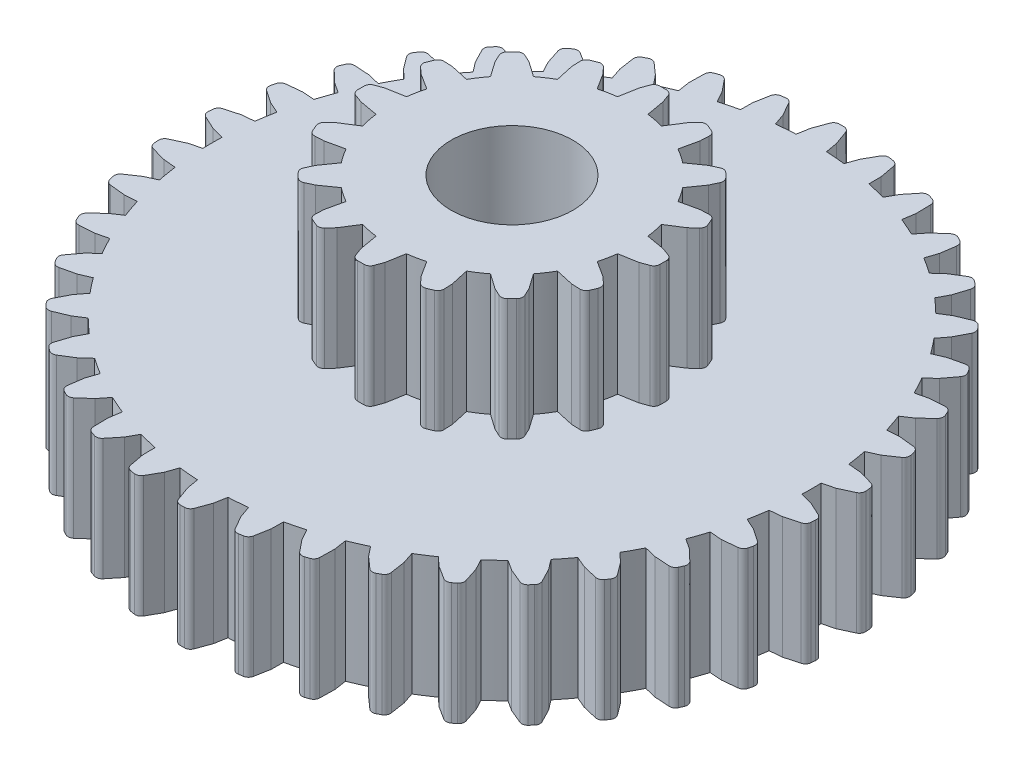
from build123d import *

# Parameters (mm, degrees)
SKETCH1_R                = 62.5475
SKETCH1_R_2              = 12.7
BOSS_EXTRUDE1_DEPTH      = 25.4
BOSS_EXTRUDE2_DEPTH      = 25.4
FILLET1_R                = 1.27
CIRPATTERN1_COUNT        = 38
FILLET1_OF_CIRPATTERN1_R = 1.27
SKETCH3_R                = 25.4
SKETCH3_R_2              = 12.7
BOSS_EXTRUDE3_DEPTH      = 25.4
BOSS_EXTRUDE4_DEPTH      = 25.4
CIRPATTERN2_COUNT        = 16


with BuildPart() as part:
    # Sketch1 → Boss-Extrude1 (new body)
    with BuildSketch(Plane(origin=(0, 0, 0), x_dir=(1, 0, 0), z_dir=(0, 1, 0))):
        with Locations(Location((0, 0, 0), (0, 0, 270))):
            Circle(SKETCH1_R)
        with Locations(Location((0, 0, 0), (0, 0, 270))):
            Circle(SKETCH1_R_2, mode=Mode.SUBTRACT)
    extrude(amount=BOSS_EXTRUDE1_DEPTH)

    # Sketch2 → Boss-Extrude2 (add)
    with BuildSketch(Plane(origin=(0, 25.4, 0), x_dir=(1, 0, 0), z_dir=(0, 1, 0))):
        Polygon((-3.175, 62.466864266), (3.175, 62.466864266), (2.727129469, 65.006864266), (1.340402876, 68.816864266), (-1.340402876, 68.816864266), (-2.727129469, 65.006864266), align=None)
    boss_extrude2 = extrude(amount=-BOSS_EXTRUDE2_DEPTH)

    # Fillet1
    fillet1_edges = [part.edges().sort_by_distance(p)[0] for p in [
        (-1.340402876, 12.7, -68.816864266),
        (1.340402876, 12.7, -68.816864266),
    ]]
    fillet(fillet1_edges, radius=FILLET1_R)

    # CirPattern1: Boss-Extrude2 ×38 about axis
    cirpattern1_axis = Axis((0, 0, 0), (0, 1, 0))
    for i in range(1, CIRPATTERN1_COUNT):
        add(boss_extrude2.rotate(cirpattern1_axis, i * 360 / CIRPATTERN1_COUNT))

    # Fillet1 of CirPattern1
    fillet1_of_cirpattern1_edges = [part.edges().sort_by_distance(p)[0] for p in [
        (-12.649005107, 12.7, -67.657668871),
        (-10.00476205, 12.7, -68.098914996),
        (-23.612575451, 12.7, -64.65294864),
        (-21.077023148, 12.7, -65.523404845),
        (-33.93205629, 12.7, -59.884664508),
        (-31.574357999, 12.7, -61.160587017),
        (-43.325959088, 12.7, -53.482882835),
        (-41.210426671, 12.7, -55.129467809),
        (-51.538042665, 12.7, -45.622227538),
        (-49.722382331, 12.7, -47.594560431),
        (-58.344302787, 12.7, -36.517116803),
        (-56.878041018, 12.7, -38.761397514),
        (-63.559082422, 12.7, -26.415914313),
        (-62.482215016, 12.7, -28.870924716),
        (-67.040135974, 12.7, -15.594154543),
        (-66.382037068, 12.7, -18.192928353),
        (-68.692509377, 12.7, -4.347026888),
        (-68.471130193, 12.7, -7.01867633),
        (-68.471130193, 12.7, 7.01867633),
        (-68.692509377, 12.7, 4.347026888),
        (-66.382037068, 12.7, 18.192928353),
        (-67.040135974, 12.7, 15.594154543),
        (-62.482215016, 12.7, 28.870924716),
        (-63.559082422, 12.7, 26.415914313),
        (-56.878041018, 12.7, 38.761397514),
        (-58.344302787, 12.7, 36.517116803),
        (-49.722382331, 12.7, 47.594560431),
        (-51.538042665, 12.7, 45.622227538),
        (-41.210426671, 12.7, 55.129467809),
        (-43.325959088, 12.7, 53.482882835),
        (-31.574357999, 12.7, 61.160587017),
        (-33.93205629, 12.7, 59.884664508),
        (-21.077023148, 12.7, 65.523404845),
        (-23.612575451, 12.7, 64.65294864),
        (-10.00476205, 12.7, 68.098914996),
        (-12.649005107, 12.7, 67.657668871),
        (1.340402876, 12.7, 68.816864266),
        (-1.340402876, 12.7, 68.816864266),
        (12.649005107, 12.7, 67.657668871),
        (10.00476205, 12.7, 68.098914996),
        (23.612575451, 12.7, 64.65294864),
        (21.077023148, 12.7, 65.523404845),
        (33.93205629, 12.7, 59.884664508),
        (31.574357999, 12.7, 61.160587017),
        (43.325959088, 12.7, 53.482882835),
        (41.210426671, 12.7, 55.129467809),
        (51.538042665, 12.7, 45.622227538),
        (49.722382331, 12.7, 47.594560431),
        (58.344302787, 12.7, 36.517116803),
        (56.878041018, 12.7, 38.761397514),
        (63.559082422, 12.7, 26.415914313),
        (62.482215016, 12.7, 28.870924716),
        (67.040135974, 12.7, 15.594154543),
        (66.382037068, 12.7, 18.192928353),
        (68.692509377, 12.7, 4.347026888),
        (68.471130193, 12.7, 7.01867633),
        (68.471130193, 12.7, -7.01867633),
        (68.692509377, 12.7, -4.347026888),
        (66.382037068, 12.7, -18.192928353),
        (67.040135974, 12.7, -15.594154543),
        (62.482215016, 12.7, -28.870924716),
        (63.559082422, 12.7, -26.415914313),
        (56.878041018, 12.7, -38.761397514),
        (58.344302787, 12.7, -36.517116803),
        (49.722382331, 12.7, -47.594560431),
        (51.538042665, 12.7, -45.622227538),
        (41.210426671, 12.7, -55.129467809),
        (43.325959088, 12.7, -53.482882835),
        (31.574357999, 12.7, -61.160587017),
        (33.93205629, 12.7, -59.884664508),
        (21.077023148, 12.7, -65.523404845),
        (23.612575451, 12.7, -64.65294864),
        (10.00476205, 12.7, -68.098914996),
        (12.649005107, 12.7, -67.657668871),
    ]]
    fillet(fillet1_of_cirpattern1_edges, radius=FILLET1_OF_CIRPATTERN1_R)

    # Sketch3 → Boss-Extrude3 (add)
    with BuildSketch(Plane(origin=(0, 25.4, 0), x_dir=(1, 0, 0), z_dir=(0, 1, 0))):
        with Locations(Location((0, 0, 0), (0, 0, 270))):
            Circle(SKETCH3_R)
        with Locations(Location((0, 0, 0), (0, 0, 270))):
            Circle(SKETCH3_R_2, mode=Mode.SUBTRACT)
    extrude(amount=BOSS_EXTRUDE3_DEPTH)

    # Sketch4 → Boss-Extrude4 (add)
    with BuildSketch(Plane(origin=(0, 50.8, 0), x_dir=(1, 0, 0), z_dir=(0, 1, 0))):
        with BuildLine():
            Line((-3.175, 25.200781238), (3.175, 25.200781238))
            Line((3.175, 25.200781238), (2.503194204, 29.010781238))
            Line((2.503194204, 29.010781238), (1.882855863, 30.71514682))
            ThreePointArc((1.882855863, 30.71514682), (1.417888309, 31.321104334), (0.689446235, 31.550781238))
            Line((0.689446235, 31.550781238), (-0.689446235, 31.550781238))
            ThreePointArc((-0.689446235, 31.550781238), (-1.417888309, 31.321104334), (-1.882855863, 30.71514682))
            Line((-1.882855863, 30.71514682), (-2.503194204, 29.010781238))
            Line((-2.503194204, 29.010781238), (-3.175, 25.200781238))
        make_face()
    boss_extrude4 = extrude(amount=-BOSS_EXTRUDE4_DEPTH)

    # CirPattern2: Boss-Extrude4 ×16 about axis
    cirpattern2_axis = Axis((0, 0, 0), (0, 1, 0))
    for i in range(1, CIRPATTERN2_COUNT):
        add(boss_extrude4.rotate(cirpattern2_axis, i * 360 / CIRPATTERN2_COUNT))


solid = part.part
